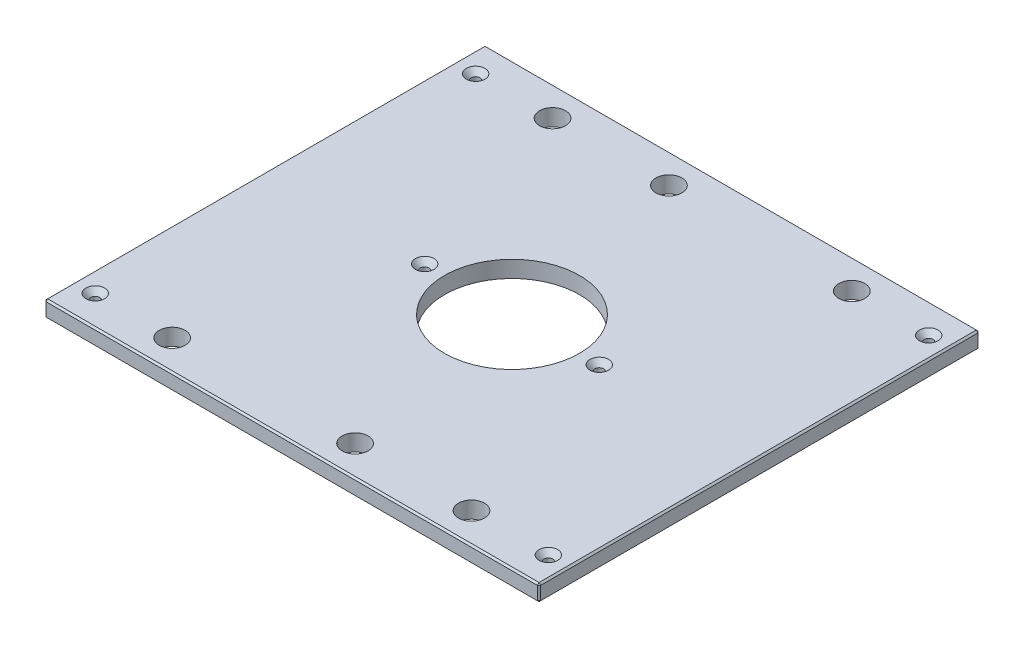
ISO-10303-21;
HEADER;
FILE_DESCRIPTION(('STEP AP214'),'2;1');
FILE_NAME('part.step','',(''),(''),'','','');
FILE_SCHEMA(('AUTOMOTIVE_DESIGN { 1 0 10303 214 1 1 1 1 }'));
ENDSEC;
DATA;
#1=APPLICATION_CONTEXT('core data for automotive mechanical design processes');
#2=APPLICATION_PROTOCOL_DEFINITION('international standard','automotive_design',2000,#1);
#3=PRODUCT_CONTEXT('',#1,'mechanical');
#4=PRODUCT('Part','Part','',(#3));
#5=PRODUCT_RELATED_PRODUCT_CATEGORY('part','',(#4));
#6=PRODUCT_DEFINITION_FORMATION('','',#4);
#7=PRODUCT_DEFINITION_CONTEXT('part definition',#1,'design');
#8=PRODUCT_DEFINITION('design','',#6,#7);
#9=PRODUCT_DEFINITION_SHAPE('','',#8);
#10=(LENGTH_UNIT() NAMED_UNIT(*) SI_UNIT(.MILLI.,.METRE.));
#11=(NAMED_UNIT(*) PLANE_ANGLE_UNIT() SI_UNIT($,.RADIAN.));
#12=(NAMED_UNIT(*) SI_UNIT($,.STERADIAN.) SOLID_ANGLE_UNIT());
#13=UNCERTAINTY_MEASURE_WITH_UNIT(LENGTH_MEASURE(1.E-05),#10,'distance_accuracy_value','');
#14=(GEOMETRIC_REPRESENTATION_CONTEXT(3) GLOBAL_UNCERTAINTY_ASSIGNED_CONTEXT((#13)) GLOBAL_UNIT_ASSIGNED_CONTEXT((#10,
#11,#12)) REPRESENTATION_CONTEXT('',''));
#15=CARTESIAN_POINT('',(0.,0.,0.));
#16=DIRECTION('',(0.,0.,1.));
#17=DIRECTION('',(1.,0.,0.));
#18=AXIS2_PLACEMENT_3D('',#15,#16,#17);
#19=CARTESIAN_POINT('',(-188.9125,12.7,-168.275));
#20=DIRECTION('',(1.,0.,0.));
#21=DIRECTION('',(0.,0.,-1.));
#22=AXIS2_PLACEMENT_3D('',#19,#20,#21);
#23=PLANE('',#22);
#24=DIRECTION('',(0.,0.,-1.));
#25=VECTOR('',#24,1.);
#26=CARTESIAN_POINT('',(-188.9125,11.4300000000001,-168.275));
#27=LINE('',#26,#25);
#28=CARTESIAN_POINT('',(-188.9125,11.4300000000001,167.005));
#29=VERTEX_POINT('',#28);
#30=CARTESIAN_POINT('',(-188.9125,11.4300000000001,-167.005));
#31=VERTEX_POINT('',#30);
#32=EDGE_CURVE('E134',#29,#31,#27,.T.);
#33=ORIENTED_EDGE('',*,*,#32,.T.);
#34=DIRECTION('',(0.,-1.,0.));
#35=VECTOR('',#34,1.);
#36=CARTESIAN_POINT('',(-188.9125,12.7,-167.005));
#37=LINE('',#36,#35);
#38=CARTESIAN_POINT('',(-188.9125,1.26999999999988,-167.005));
#39=VERTEX_POINT('',#38);
#40=EDGE_CURVE('E130',#31,#39,#37,.T.);
#41=ORIENTED_EDGE('',*,*,#40,.T.);
#42=DIRECTION('',(0.,0.,1.));
#43=VECTOR('',#42,1.);
#44=CARTESIAN_POINT('',(-188.9125,1.26999999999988,-168.275));
#45=LINE('',#44,#43);
#46=CARTESIAN_POINT('',(-188.9125,1.26999999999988,167.005));
#47=VERTEX_POINT('',#46);
#48=EDGE_CURVE('E125',#39,#47,#45,.T.);
#49=ORIENTED_EDGE('',*,*,#48,.T.);
#50=DIRECTION('',(0.,1.,0.));
#51=VECTOR('',#50,1.);
#52=CARTESIAN_POINT('',(-188.9125,12.7,167.005));
#53=LINE('',#52,#51);
#54=EDGE_CURVE('E127',#47,#29,#53,.T.);
#55=ORIENTED_EDGE('',*,*,#54,.T.);
#56=EDGE_LOOP('',(#33,#41,#49,#55));
#57=FACE_BOUND('',#56,.T.);
#58=ADVANCED_FACE('F34',(#57),#23,.F.);
#59=CARTESIAN_POINT('',(-188.9125,12.7,168.275));
#60=DIRECTION('',(0.,0.,-1.));
#61=DIRECTION('',(-1.,0.,0.));
#62=AXIS2_PLACEMENT_3D('',#59,#60,#61);
#63=PLANE('',#62);
#64=DIRECTION('',(1.,0.,0.));
#65=VECTOR('',#64,1.);
#66=CARTESIAN_POINT('',(-188.9125,1.26999999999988,168.275));
#67=LINE('',#66,#65);
#68=CARTESIAN_POINT('',(-187.6425,1.26999999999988,168.275));
#69=VERTEX_POINT('',#68);
#70=CARTESIAN_POINT('',(187.6425,1.26999999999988,168.275));
#71=VERTEX_POINT('',#70);
#72=EDGE_CURVE('E57',#69,#71,#67,.T.);
#73=ORIENTED_EDGE('',*,*,#72,.T.);
#74=DIRECTION('',(0.,1.,0.));
#75=VECTOR('',#74,1.);
#76=CARTESIAN_POINT('',(187.6425,12.7,168.275));
#77=LINE('',#76,#75);
#78=CARTESIAN_POINT('',(187.6425,11.4300000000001,168.275));
#79=VERTEX_POINT('',#78);
#80=EDGE_CURVE('E11',#71,#79,#77,.T.);
#81=ORIENTED_EDGE('',*,*,#80,.T.);
#82=DIRECTION('',(-1.,0.,0.));
#83=VECTOR('',#82,1.);
#84=CARTESIAN_POINT('',(-188.9125,11.4300000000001,168.275));
#85=LINE('',#84,#83);
#86=CARTESIAN_POINT('',(-187.6425,11.4300000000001,168.275));
#87=VERTEX_POINT('',#86);
#88=EDGE_CURVE('E43',#79,#87,#85,.T.);
#89=ORIENTED_EDGE('',*,*,#88,.T.);
#90=DIRECTION('',(0.,-1.,0.));
#91=VECTOR('',#90,1.);
#92=CARTESIAN_POINT('',(-187.6425,12.7,168.275));
#93=LINE('',#92,#91);
#94=EDGE_CURVE('E290',#87,#69,#93,.T.);
#95=ORIENTED_EDGE('',*,*,#94,.T.);
#96=EDGE_LOOP('',(#73,#81,#89,#95));
#97=FACE_BOUND('',#96,.T.);
#98=ADVANCED_FACE('F359',(#97),#63,.F.);
#99=CARTESIAN_POINT('',(188.9125,12.7,-168.275));
#100=DIRECTION('',(-1.,0.,0.));
#101=DIRECTION('',(0.,0.,1.));
#102=AXIS2_PLACEMENT_3D('',#99,#100,#101);
#103=PLANE('',#102);
#104=DIRECTION('',(0.,0.,-1.));
#105=VECTOR('',#104,1.);
#106=CARTESIAN_POINT('',(188.9125,1.26999999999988,-168.275));
#107=LINE('',#106,#105);
#108=CARTESIAN_POINT('',(188.9125,1.26999999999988,167.005));
#109=VERTEX_POINT('',#108);
#110=CARTESIAN_POINT('',(188.9125,1.26999999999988,-167.005));
#111=VERTEX_POINT('',#110);
#112=EDGE_CURVE('E285',#109,#111,#107,.T.);
#113=ORIENTED_EDGE('',*,*,#112,.T.);
#114=DIRECTION('',(0.,1.,0.));
#115=VECTOR('',#114,1.);
#116=CARTESIAN_POINT('',(188.9125,12.7,-167.005));
#117=LINE('',#116,#115);
#118=CARTESIAN_POINT('',(188.9125,11.4300000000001,-167.005));
#119=VERTEX_POINT('',#118);
#120=EDGE_CURVE('E287',#111,#119,#117,.T.);
#121=ORIENTED_EDGE('',*,*,#120,.T.);
#122=DIRECTION('',(0.,0.,1.));
#123=VECTOR('',#122,1.);
#124=CARTESIAN_POINT('',(188.9125,11.4300000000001,168.275));
#125=LINE('',#124,#123);
#126=CARTESIAN_POINT('',(188.9125,11.4300000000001,167.005));
#127=VERTEX_POINT('',#126);
#128=EDGE_CURVE('E283',#119,#127,#125,.T.);
#129=ORIENTED_EDGE('',*,*,#128,.T.);
#130=DIRECTION('',(0.,-1.,0.));
#131=VECTOR('',#130,1.);
#132=CARTESIAN_POINT('',(188.9125,12.7,167.005));
#133=LINE('',#132,#131);
#134=EDGE_CURVE('E281',#127,#109,#133,.T.);
#135=ORIENTED_EDGE('',*,*,#134,.T.);
#136=EDGE_LOOP('',(#113,#121,#129,#135));
#137=FACE_BOUND('',#136,.T.);
#138=ADVANCED_FACE('F346',(#137),#103,.F.);
#139=CARTESIAN_POINT('',(-188.9125,12.7,-168.275));
#140=DIRECTION('',(0.,0.,1.));
#141=DIRECTION('',(1.,0.,0.));
#142=AXIS2_PLACEMENT_3D('',#139,#140,#141);
#143=PLANE('',#142);
#144=DIRECTION('',(-1.,0.,0.));
#145=VECTOR('',#144,1.);
#146=CARTESIAN_POINT('',(-188.9125,1.26999999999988,-168.275));
#147=LINE('',#146,#145);
#148=CARTESIAN_POINT('',(187.6425,1.26999999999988,-168.275));
#149=VERTEX_POINT('',#148);
#150=CARTESIAN_POINT('',(-187.6425,1.26999999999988,-168.275));
#151=VERTEX_POINT('',#150);
#152=EDGE_CURVE('E257',#149,#151,#147,.T.);
#153=ORIENTED_EDGE('',*,*,#152,.T.);
#154=DIRECTION('',(0.,1.,0.));
#155=VECTOR('',#154,1.);
#156=CARTESIAN_POINT('',(-187.6425,12.7,-168.275));
#157=LINE('',#156,#155);
#158=CARTESIAN_POINT('',(-187.6425,11.4300000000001,-168.275));
#159=VERTEX_POINT('',#158);
#160=EDGE_CURVE('E261',#151,#159,#157,.T.);
#161=ORIENTED_EDGE('',*,*,#160,.T.);
#162=DIRECTION('',(1.,0.,0.));
#163=VECTOR('',#162,1.);
#164=CARTESIAN_POINT('',(188.9125,11.4300000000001,-168.275));
#165=LINE('',#164,#163);
#166=CARTESIAN_POINT('',(187.6425,11.4300000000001,-168.275));
#167=VERTEX_POINT('',#166);
#168=EDGE_CURVE('E259',#159,#167,#165,.T.);
#169=ORIENTED_EDGE('',*,*,#168,.T.);
#170=DIRECTION('',(0.,-1.,0.));
#171=VECTOR('',#170,1.);
#172=CARTESIAN_POINT('',(187.6425,12.7,-168.275));
#173=LINE('',#172,#171);
#174=EDGE_CURVE('E255',#167,#149,#173,.T.);
#175=ORIENTED_EDGE('',*,*,#174,.T.);
#176=EDGE_LOOP('',(#153,#161,#169,#175));
#177=FACE_BOUND('',#176,.T.);
#178=ADVANCED_FACE('F320',(#177),#143,.F.);
#179=CARTESIAN_POINT('',(0.,12.7,0.));
#180=DIRECTION('',(0.,1.,0.));
#181=DIRECTION('',(0.,0.,1.));
#182=AXIS2_PLACEMENT_3D('',#179,#180,#181);
#183=PLANE('',#182);
#184=CARTESIAN_POINT('',(173.0375,12.7,-145.25498));
#185=DIRECTION('',(0.,1.,0.));
#186=DIRECTION('',(0.,0.,1.));
#187=AXIS2_PLACEMENT_3D('',#184,#185,#186);
#188=CIRCLE('',#187,7.13739999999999);
#189=CARTESIAN_POINT('',(173.0375,12.7,-138.11758));
#190=VERTEX_POINT('',#189);
#191=EDGE_CURVE('E783',#190,#190,#188,.T.);
#192=ORIENTED_EDGE('',*,*,#191,.F.);
#193=EDGE_LOOP('',(#192));
#194=FACE_BOUND('',#193,.T.);
#195=CARTESIAN_POINT('',(173.0375,12.7,145.25498));
#196=DIRECTION('',(0.,1.,0.));
#197=DIRECTION('',(0.,0.,1.));
#198=AXIS2_PLACEMENT_3D('',#195,#196,#197);
#199=CIRCLE('',#198,7.13739999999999);
#200=CARTESIAN_POINT('',(173.0375,12.7,152.39238));
#201=VERTEX_POINT('',#200);
#202=EDGE_CURVE('E787',#201,#201,#199,.T.);
#203=ORIENTED_EDGE('',*,*,#202,.F.);
#204=EDGE_LOOP('',(#203));
#205=FACE_BOUND('',#204,.T.);
#206=CARTESIAN_POINT('',(-173.0375,12.7,145.25498));
#207=DIRECTION('',(0.,1.,0.));
#208=DIRECTION('',(0.,0.,1.));
#209=AXIS2_PLACEMENT_3D('',#206,#207,#208);
#210=CIRCLE('',#209,7.13739999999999);
#211=CARTESIAN_POINT('',(-173.0375,12.7,152.39238));
#212=VERTEX_POINT('',#211);
#213=EDGE_CURVE('E791',#212,#212,#210,.T.);
#214=ORIENTED_EDGE('',*,*,#213,.F.);
#215=EDGE_LOOP('',(#214));
#216=FACE_BOUND('',#215,.T.);
#217=CARTESIAN_POINT('',(-66.675,12.7,0.));
#218=DIRECTION('',(0.,1.,0.));
#219=DIRECTION('',(0.,0.,1.));
#220=AXIS2_PLACEMENT_3D('',#217,#218,#219);
#221=CIRCLE('',#220,7.1374);
#222=CARTESIAN_POINT('',(-66.675,12.7,7.1374));
#223=VERTEX_POINT('',#222);
#224=EDGE_CURVE('E795',#223,#223,#221,.T.);
#225=ORIENTED_EDGE('',*,*,#224,.F.);
#226=EDGE_LOOP('',(#225));
#227=FACE_BOUND('',#226,.T.);
#228=CARTESIAN_POINT('',(66.675,12.7,0.));
#229=DIRECTION('',(0.,1.,0.));
#230=DIRECTION('',(0.,0.,1.));
#231=AXIS2_PLACEMENT_3D('',#228,#229,#230);
#232=CIRCLE('',#231,7.1374);
#233=CARTESIAN_POINT('',(66.675,12.7,7.1374));
#234=VERTEX_POINT('',#233);
#235=EDGE_CURVE('E799',#234,#234,#232,.T.);
#236=ORIENTED_EDGE('',*,*,#235,.F.);
#237=EDGE_LOOP('',(#236));
#238=FACE_BOUND('',#237,.T.);
#239=CARTESIAN_POINT('',(-173.0375,12.7,-145.25498));
#240=DIRECTION('',(0.,1.,0.));
#241=DIRECTION('',(0.,0.,1.));
#242=AXIS2_PLACEMENT_3D('',#239,#240,#241);
#243=CIRCLE('',#242,7.13739999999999);
#244=CARTESIAN_POINT('',(-173.0375,12.7,-138.11758));
#245=VERTEX_POINT('',#244);
#246=EDGE_CURVE('E802',#245,#245,#243,.T.);
#247=ORIENTED_EDGE('',*,*,#246,.F.);
#248=EDGE_LOOP('',(#247));
#249=FACE_BOUND('',#248,.T.);
#250=DIRECTION('',(0.,0.,-1.));
#251=VECTOR('',#250,1.);
#252=CARTESIAN_POINT('',(187.6425,12.7,-168.275));
#253=LINE('',#252,#251);
#254=CARTESIAN_POINT('',(187.6425,12.7,167.005));
#255=VERTEX_POINT('',#254);
#256=CARTESIAN_POINT('',(187.6425,12.7,-167.005));
#257=VERTEX_POINT('',#256);
#258=EDGE_CURVE('E268',#255,#257,#253,.T.);
#259=ORIENTED_EDGE('',*,*,#258,.T.);
#260=DIRECTION('',(-1.,0.,0.));
#261=VECTOR('',#260,1.);
#262=CARTESIAN_POINT('',(-188.9125,12.7,-167.005));
#263=LINE('',#262,#261);
#264=CARTESIAN_POINT('',(-187.6425,12.7,-167.005));
#265=VERTEX_POINT('',#264);
#266=EDGE_CURVE('E270',#257,#265,#263,.T.);
#267=ORIENTED_EDGE('',*,*,#266,.T.);
#268=DIRECTION('',(0.,0.,1.));
#269=VECTOR('',#268,1.);
#270=CARTESIAN_POINT('',(-187.6425,12.7,168.275));
#271=LINE('',#270,#269);
#272=CARTESIAN_POINT('',(-187.6425,12.7,167.005));
#273=VERTEX_POINT('',#272);
#274=EDGE_CURVE('E266',#265,#273,#271,.T.);
#275=ORIENTED_EDGE('',*,*,#274,.T.);
#276=DIRECTION('',(1.,0.,0.));
#277=VECTOR('',#276,1.);
#278=CARTESIAN_POINT('',(188.9125,12.7,167.005));
#279=LINE('',#278,#277);
#280=EDGE_CURVE('E264',#273,#255,#279,.T.);
#281=ORIENTED_EDGE('',*,*,#280,.T.);
#282=EDGE_LOOP('',(#259,#267,#275,#281));
#283=FACE_BOUND('',#282,.T.);
#284=CARTESIAN_POINT('',(114.3,12.7,-145.25498));
#285=DIRECTION('',(0.,1.,0.));
#286=DIRECTION('',(0.,0.,1.));
#287=AXIS2_PLACEMENT_3D('',#284,#285,#286);
#288=CIRCLE('',#287,9.921875);
#289=CARTESIAN_POINT('',(114.3,12.7,-135.333105));
#290=VERTEX_POINT('',#289);
#291=EDGE_CURVE('E203',#290,#290,#288,.T.);
#292=ORIENTED_EDGE('',*,*,#291,.F.);
#293=EDGE_LOOP('',(#292));
#294=FACE_BOUND('',#293,.T.);
#295=CARTESIAN_POINT('',(-114.3,12.7,-145.25498));
#296=DIRECTION('',(0.,1.,0.));
#297=DIRECTION('',(0.,0.,1.));
#298=AXIS2_PLACEMENT_3D('',#295,#296,#297);
#299=CIRCLE('',#298,9.921875);
#300=CARTESIAN_POINT('',(-114.3,12.7,-135.333105));
#301=VERTEX_POINT('',#300);
#302=EDGE_CURVE('E213',#301,#301,#299,.T.);
#303=ORIENTED_EDGE('',*,*,#302,.F.);
#304=EDGE_LOOP('',(#303));
#305=FACE_BOUND('',#304,.T.);
#306=CARTESIAN_POINT('',(114.3,12.7,145.25498));
#307=DIRECTION('',(0.,1.,0.));
#308=DIRECTION('',(0.,0.,1.));
#309=AXIS2_PLACEMENT_3D('',#306,#307,#308);
#310=CIRCLE('',#309,9.921875);
#311=CARTESIAN_POINT('',(114.3,12.7,155.176855));
#312=VERTEX_POINT('',#311);
#313=EDGE_CURVE('E224',#312,#312,#310,.T.);
#314=ORIENTED_EDGE('',*,*,#313,.F.);
#315=EDGE_LOOP('',(#314));
#316=FACE_BOUND('',#315,.T.);
#317=CARTESIAN_POINT('',(-114.3,12.7,145.25498));
#318=DIRECTION('',(0.,1.,0.));
#319=DIRECTION('',(0.,0.,1.));
#320=AXIS2_PLACEMENT_3D('',#317,#318,#319);
#321=CIRCLE('',#320,9.921875);
#322=CARTESIAN_POINT('',(-114.3,12.7,155.176855));
#323=VERTEX_POINT('',#322);
#324=EDGE_CURVE('E230',#323,#323,#321,.T.);
#325=ORIENTED_EDGE('',*,*,#324,.F.);
#326=EDGE_LOOP('',(#325));
#327=FACE_BOUND('',#326,.T.);
#328=CARTESIAN_POINT('',(-25.4,12.7,-145.25498));
#329=DIRECTION('',(0.,1.,0.));
#330=DIRECTION('',(0.,0.,1.));
#331=AXIS2_PLACEMENT_3D('',#328,#329,#330);
#332=CIRCLE('',#331,9.921875);
#333=CARTESIAN_POINT('',(-25.4,12.7,-135.333105));
#334=VERTEX_POINT('',#333);
#335=EDGE_CURVE('E236',#334,#334,#332,.T.);
#336=ORIENTED_EDGE('',*,*,#335,.F.);
#337=EDGE_LOOP('',(#336));
#338=FACE_BOUND('',#337,.T.);
#339=CARTESIAN_POINT('',(25.4,12.7,145.25498));
#340=DIRECTION('',(0.,1.,0.));
#341=DIRECTION('',(0.,0.,1.));
#342=AXIS2_PLACEMENT_3D('',#339,#340,#341);
#343=CIRCLE('',#342,9.921875);
#344=CARTESIAN_POINT('',(25.4,12.7,155.176855));
#345=VERTEX_POINT('',#344);
#346=EDGE_CURVE('E242',#345,#345,#343,.T.);
#347=ORIENTED_EDGE('',*,*,#346,.F.);
#348=EDGE_LOOP('',(#347));
#349=FACE_BOUND('',#348,.T.);
#350=CARTESIAN_POINT('',(0.,12.7,0.));
#351=DIRECTION('',(0.,1.,0.));
#352=DIRECTION('',(0.,0.,1.));
#353=AXIS2_PLACEMENT_3D('',#350,#351,#352);
#354=CIRCLE('',#353,51.562);
#355=CARTESIAN_POINT('',(0.,12.7,51.562));
#356=VERTEX_POINT('',#355);
#357=EDGE_CURVE('E248',#356,#356,#354,.T.);
#358=ORIENTED_EDGE('',*,*,#357,.F.);
#359=EDGE_LOOP('',(#358));
#360=FACE_BOUND('',#359,.T.);
#361=ADVANCED_FACE('F368',(#194,#205,#216,#227,#238,#249,#283,#294,#305,#316,#327,#338,#349,
#360),#183,.T.);
#362=CARTESIAN_POINT('',(0.,0.,0.));
#363=DIRECTION('',(0.,1.,0.));
#364=DIRECTION('',(0.,0.,1.));
#365=AXIS2_PLACEMENT_3D('',#362,#363,#364);
#366=PLANE('',#365);
#367=CARTESIAN_POINT('',(173.0375,0.,-145.25498));
#368=DIRECTION('',(0.,1.,0.));
#369=DIRECTION('',(0.,0.,1.));
#370=AXIS2_PLACEMENT_3D('',#367,#368,#369);
#371=CIRCLE('',#370,3.3782);
#372=CARTESIAN_POINT('',(173.0375,0.,-141.87678));
#373=VERTEX_POINT('',#372);
#374=EDGE_CURVE('E836',#373,#373,#371,.T.);
#375=ORIENTED_EDGE('',*,*,#374,.T.);
#376=EDGE_LOOP('',(#375));
#377=FACE_BOUND('',#376,.T.);
#378=CARTESIAN_POINT('',(173.0375,0.,145.25498));
#379=DIRECTION('',(0.,1.,0.));
#380=DIRECTION('',(0.,0.,1.));
#381=AXIS2_PLACEMENT_3D('',#378,#379,#380);
#382=CIRCLE('',#381,3.3782);
#383=CARTESIAN_POINT('',(173.0375,0.,148.63318));
#384=VERTEX_POINT('',#383);
#385=EDGE_CURVE('E829',#384,#384,#382,.T.);
#386=ORIENTED_EDGE('',*,*,#385,.T.);
#387=EDGE_LOOP('',(#386));
#388=FACE_BOUND('',#387,.T.);
#389=CARTESIAN_POINT('',(-173.0375,0.,145.25498));
#390=DIRECTION('',(0.,1.,0.));
#391=DIRECTION('',(0.,0.,1.));
#392=AXIS2_PLACEMENT_3D('',#389,#390,#391);
#393=CIRCLE('',#392,3.3782);
#394=CARTESIAN_POINT('',(-173.0375,0.,148.63318));
#395=VERTEX_POINT('',#394);
#396=EDGE_CURVE('E822',#395,#395,#393,.T.);
#397=ORIENTED_EDGE('',*,*,#396,.T.);
#398=EDGE_LOOP('',(#397));
#399=FACE_BOUND('',#398,.T.);
#400=CARTESIAN_POINT('',(-66.675,0.,0.));
#401=DIRECTION('',(0.,1.,0.));
#402=DIRECTION('',(0.,0.,1.));
#403=AXIS2_PLACEMENT_3D('',#400,#401,#402);
#404=CIRCLE('',#403,3.3782);
#405=CARTESIAN_POINT('',(-66.675,0.,3.3782));
#406=VERTEX_POINT('',#405);
#407=EDGE_CURVE('E815',#406,#406,#404,.T.);
#408=ORIENTED_EDGE('',*,*,#407,.T.);
#409=EDGE_LOOP('',(#408));
#410=FACE_BOUND('',#409,.T.);
#411=CARTESIAN_POINT('',(66.675,0.,0.));
#412=DIRECTION('',(0.,1.,0.));
#413=DIRECTION('',(0.,0.,1.));
#414=AXIS2_PLACEMENT_3D('',#411,#412,#413);
#415=CIRCLE('',#414,3.3782);
#416=CARTESIAN_POINT('',(66.675,0.,3.3782));
#417=VERTEX_POINT('',#416);
#418=EDGE_CURVE('E805',#417,#417,#415,.T.);
#419=ORIENTED_EDGE('',*,*,#418,.T.);
#420=EDGE_LOOP('',(#419));
#421=FACE_BOUND('',#420,.T.);
#422=CARTESIAN_POINT('',(-173.0375,0.,-145.25498));
#423=DIRECTION('',(0.,1.,0.));
#424=DIRECTION('',(0.,0.,1.));
#425=AXIS2_PLACEMENT_3D('',#422,#423,#424);
#426=CIRCLE('',#425,3.3782);
#427=CARTESIAN_POINT('',(-173.0375,0.,-141.87678));
#428=VERTEX_POINT('',#427);
#429=EDGE_CURVE('E216',#428,#428,#426,.T.);
#430=ORIENTED_EDGE('',*,*,#429,.T.);
#431=EDGE_LOOP('',(#430));
#432=FACE_BOUND('',#431,.T.);
#433=DIRECTION('',(0.,0.,-1.));
#434=VECTOR('',#433,1.);
#435=CARTESIAN_POINT('',(-187.6425,0.,0.));
#436=LINE('',#435,#434);
#437=CARTESIAN_POINT('',(-187.6425,0.,167.005));
#438=VERTEX_POINT('',#437);
#439=CARTESIAN_POINT('',(-187.6425,0.,-167.005));
#440=VERTEX_POINT('',#439);
#441=EDGE_CURVE('E157',#438,#440,#436,.T.);
#442=ORIENTED_EDGE('',*,*,#441,.T.);
#443=DIRECTION('',(1.,0.,0.));
#444=VECTOR('',#443,1.);
#445=CARTESIAN_POINT('',(0.,0.,-167.005));
#446=LINE('',#445,#444);
#447=CARTESIAN_POINT('',(187.6425,0.,-167.005));
#448=VERTEX_POINT('',#447);
#449=EDGE_CURVE('E278',#440,#448,#446,.T.);
#450=ORIENTED_EDGE('',*,*,#449,.T.);
#451=DIRECTION('',(0.,0.,1.));
#452=VECTOR('',#451,1.);
#453=CARTESIAN_POINT('',(187.6425,0.,0.));
#454=LINE('',#453,#452);
#455=CARTESIAN_POINT('',(187.6425,0.,167.005));
#456=VERTEX_POINT('',#455);
#457=EDGE_CURVE('E276',#448,#456,#454,.T.);
#458=ORIENTED_EDGE('',*,*,#457,.T.);
#459=DIRECTION('',(-1.,0.,0.));
#460=VECTOR('',#459,1.);
#461=CARTESIAN_POINT('',(0.,0.,167.005));
#462=LINE('',#461,#460);
#463=EDGE_CURVE('E273',#456,#438,#462,.T.);
#464=ORIENTED_EDGE('',*,*,#463,.T.);
#465=EDGE_LOOP('',(#442,#450,#458,#464));
#466=FACE_BOUND('',#465,.T.);
#467=CARTESIAN_POINT('',(114.3,0.,-145.25498));
#468=DIRECTION('',(0.,1.,0.));
#469=DIRECTION('',(0.,0.,1.));
#470=AXIS2_PLACEMENT_3D('',#467,#468,#469);
#471=CIRCLE('',#470,9.921875);
#472=CARTESIAN_POINT('',(114.3,0.,-135.333105));
#473=VERTEX_POINT('',#472);
#474=EDGE_CURVE('E208',#473,#473,#471,.T.);
#475=ORIENTED_EDGE('',*,*,#474,.T.);
#476=EDGE_LOOP('',(#475));
#477=FACE_BOUND('',#476,.T.);
#478=CARTESIAN_POINT('',(-114.3,0.,-145.25498));
#479=DIRECTION('',(0.,1.,0.));
#480=DIRECTION('',(0.,0.,1.));
#481=AXIS2_PLACEMENT_3D('',#478,#479,#480);
#482=CIRCLE('',#481,9.921875);
#483=CARTESIAN_POINT('',(-114.3,0.,-135.333105));
#484=VERTEX_POINT('',#483);
#485=EDGE_CURVE('E221',#484,#484,#482,.T.);
#486=ORIENTED_EDGE('',*,*,#485,.T.);
#487=EDGE_LOOP('',(#486));
#488=FACE_BOUND('',#487,.T.);
#489=CARTESIAN_POINT('',(114.3,0.,145.25498));
#490=DIRECTION('',(0.,1.,0.));
#491=DIRECTION('',(0.,0.,1.));
#492=AXIS2_PLACEMENT_3D('',#489,#490,#491);
#493=CIRCLE('',#492,9.921875);
#494=CARTESIAN_POINT('',(114.3,0.,155.176855));
#495=VERTEX_POINT('',#494);
#496=EDGE_CURVE('E227',#495,#495,#493,.T.);
#497=ORIENTED_EDGE('',*,*,#496,.T.);
#498=EDGE_LOOP('',(#497));
#499=FACE_BOUND('',#498,.T.);
#500=CARTESIAN_POINT('',(-114.3,0.,145.25498));
#501=DIRECTION('',(0.,1.,0.));
#502=DIRECTION('',(0.,0.,1.));
#503=AXIS2_PLACEMENT_3D('',#500,#501,#502);
#504=CIRCLE('',#503,9.921875);
#505=CARTESIAN_POINT('',(-114.3,0.,155.176855));
#506=VERTEX_POINT('',#505);
#507=EDGE_CURVE('E233',#506,#506,#504,.T.);
#508=ORIENTED_EDGE('',*,*,#507,.T.);
#509=EDGE_LOOP('',(#508));
#510=FACE_BOUND('',#509,.T.);
#511=CARTESIAN_POINT('',(-25.4,0.,-145.25498));
#512=DIRECTION('',(0.,1.,0.));
#513=DIRECTION('',(0.,0.,1.));
#514=AXIS2_PLACEMENT_3D('',#511,#512,#513);
#515=CIRCLE('',#514,9.921875);
#516=CARTESIAN_POINT('',(-25.4,0.,-135.333105));
#517=VERTEX_POINT('',#516);
#518=EDGE_CURVE('E239',#517,#517,#515,.T.);
#519=ORIENTED_EDGE('',*,*,#518,.T.);
#520=EDGE_LOOP('',(#519));
#521=FACE_BOUND('',#520,.T.);
#522=CARTESIAN_POINT('',(25.4,0.,145.25498));
#523=DIRECTION('',(0.,1.,0.));
#524=DIRECTION('',(0.,0.,1.));
#525=AXIS2_PLACEMENT_3D('',#522,#523,#524);
#526=CIRCLE('',#525,9.921875);
#527=CARTESIAN_POINT('',(25.4,0.,155.176855));
#528=VERTEX_POINT('',#527);
#529=EDGE_CURVE('E245',#528,#528,#526,.T.);
#530=ORIENTED_EDGE('',*,*,#529,.T.);
#531=EDGE_LOOP('',(#530));
#532=FACE_BOUND('',#531,.T.);
#533=CARTESIAN_POINT('',(0.,0.,0.));
#534=DIRECTION('',(0.,1.,0.));
#535=DIRECTION('',(0.,0.,1.));
#536=AXIS2_PLACEMENT_3D('',#533,#534,#535);
#537=CIRCLE('',#536,51.562);
#538=CARTESIAN_POINT('',(0.,0.,51.562));
#539=VERTEX_POINT('',#538);
#540=EDGE_CURVE('E146',#539,#539,#537,.T.);
#541=ORIENTED_EDGE('',*,*,#540,.T.);
#542=EDGE_LOOP('',(#541));
#543=FACE_BOUND('',#542,.T.);
#544=ADVANCED_FACE('F333',(#377,#388,#399,#410,#421,#432,#466,#477,#488,#499,#510,#521,#532,
#543),#366,.F.);
#545=CARTESIAN_POINT('',(0.,0.,0.));
#546=DIRECTION('',(0.,1.,0.));
#547=DIRECTION('',(0.,0.,1.));
#548=AXIS2_PLACEMENT_3D('',#545,#546,#547);
#549=CYLINDRICAL_SURFACE('',#548,51.562);
#550=ORIENTED_EDGE('',*,*,#540,.F.);
#551=EDGE_LOOP('',(#550));
#552=FACE_BOUND('',#551,.T.);
#553=ORIENTED_EDGE('',*,*,#357,.T.);
#554=EDGE_LOOP('',(#553));
#555=FACE_BOUND('',#554,.T.);
#556=ADVANCED_FACE('F720',(#552,#555),#549,.F.);
#557=CARTESIAN_POINT('',(25.4,12.7,145.25498));
#558=DIRECTION('',(0.,1.,0.));
#559=DIRECTION('',(0.,0.,1.));
#560=AXIS2_PLACEMENT_3D('',#557,#558,#559);
#561=CYLINDRICAL_SURFACE('',#560,9.921875);
#562=ORIENTED_EDGE('',*,*,#529,.F.);
#563=EDGE_LOOP('',(#562));
#564=FACE_BOUND('',#563,.T.);
#565=ORIENTED_EDGE('',*,*,#346,.T.);
#566=EDGE_LOOP('',(#565));
#567=FACE_BOUND('',#566,.T.);
#568=ADVANCED_FACE('F711',(#564,#567),#561,.F.);
#569=CARTESIAN_POINT('',(-25.4,12.7,-145.25498));
#570=DIRECTION('',(0.,1.,0.));
#571=DIRECTION('',(0.,0.,1.));
#572=AXIS2_PLACEMENT_3D('',#569,#570,#571);
#573=CYLINDRICAL_SURFACE('',#572,9.921875);
#574=ORIENTED_EDGE('',*,*,#518,.F.);
#575=EDGE_LOOP('',(#574));
#576=FACE_BOUND('',#575,.T.);
#577=ORIENTED_EDGE('',*,*,#335,.T.);
#578=EDGE_LOOP('',(#577));
#579=FACE_BOUND('',#578,.T.);
#580=ADVANCED_FACE('F702',(#576,#579),#573,.F.);
#581=CARTESIAN_POINT('',(-114.3,12.7,145.25498));
#582=DIRECTION('',(0.,1.,0.));
#583=DIRECTION('',(0.,0.,1.));
#584=AXIS2_PLACEMENT_3D('',#581,#582,#583);
#585=CYLINDRICAL_SURFACE('',#584,9.921875);
#586=ORIENTED_EDGE('',*,*,#507,.F.);
#587=EDGE_LOOP('',(#586));
#588=FACE_BOUND('',#587,.T.);
#589=ORIENTED_EDGE('',*,*,#324,.T.);
#590=EDGE_LOOP('',(#589));
#591=FACE_BOUND('',#590,.T.);
#592=ADVANCED_FACE('F693',(#588,#591),#585,.F.);
#593=CARTESIAN_POINT('',(114.3,12.7,145.25498));
#594=DIRECTION('',(0.,1.,0.));
#595=DIRECTION('',(0.,0.,1.));
#596=AXIS2_PLACEMENT_3D('',#593,#594,#595);
#597=CYLINDRICAL_SURFACE('',#596,9.921875);
#598=ORIENTED_EDGE('',*,*,#496,.F.);
#599=EDGE_LOOP('',(#598));
#600=FACE_BOUND('',#599,.T.);
#601=ORIENTED_EDGE('',*,*,#313,.T.);
#602=EDGE_LOOP('',(#601));
#603=FACE_BOUND('',#602,.T.);
#604=ADVANCED_FACE('F684',(#600,#603),#597,.F.);
#605=CARTESIAN_POINT('',(-114.3,12.7,-145.25498));
#606=DIRECTION('',(0.,1.,0.));
#607=DIRECTION('',(0.,0.,1.));
#608=AXIS2_PLACEMENT_3D('',#605,#606,#607);
#609=CYLINDRICAL_SURFACE('',#608,9.921875);
#610=ORIENTED_EDGE('',*,*,#485,.F.);
#611=EDGE_LOOP('',(#610));
#612=FACE_BOUND('',#611,.T.);
#613=ORIENTED_EDGE('',*,*,#302,.T.);
#614=EDGE_LOOP('',(#613));
#615=FACE_BOUND('',#614,.T.);
#616=ADVANCED_FACE('F674',(#612,#615),#609,.F.);
#617=CARTESIAN_POINT('',(114.3,12.7,-145.25498));
#618=DIRECTION('',(0.,1.,0.));
#619=DIRECTION('',(0.,0.,1.));
#620=AXIS2_PLACEMENT_3D('',#617,#618,#619);
#621=CYLINDRICAL_SURFACE('',#620,9.921875);
#622=ORIENTED_EDGE('',*,*,#474,.F.);
#623=EDGE_LOOP('',(#622));
#624=FACE_BOUND('',#623,.T.);
#625=ORIENTED_EDGE('',*,*,#291,.T.);
#626=EDGE_LOOP('',(#625));
#627=FACE_BOUND('',#626,.T.);
#628=ADVANCED_FACE('F377',(#624,#627),#621,.F.);
#629=CARTESIAN_POINT('',(188.9125,12.7,167.005));
#630=DIRECTION('',(-0.707106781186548,0.,-0.707106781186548));
#631=DIRECTION('',(0.,-1.,0.));
#632=AXIS2_PLACEMENT_3D('',#629,#630,#631);
#633=PLANE('',#632);
#634=DIRECTION('',(-0.707106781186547,0.,0.707106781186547));
#635=VECTOR('',#634,1.);
#636=CARTESIAN_POINT('',(188.9125,11.4300000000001,167.005));
#637=LINE('',#636,#635);
#638=EDGE_CURVE('E38',#79,#127,#637,.F.);
#639=ORIENTED_EDGE('',*,*,#638,.F.);
#640=ORIENTED_EDGE('',*,*,#80,.F.);
#641=DIRECTION('',(0.707106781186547,0.,-0.707106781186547));
#642=VECTOR('',#641,1.);
#643=CARTESIAN_POINT('',(188.2775,1.26999999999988,167.64));
#644=LINE('',#643,#642);
#645=EDGE_CURVE('E196',#109,#71,#644,.F.);
#646=ORIENTED_EDGE('',*,*,#645,.F.);
#647=ORIENTED_EDGE('',*,*,#134,.F.);
#648=EDGE_LOOP('',(#639,#640,#646,#647));
#649=FACE_BOUND('',#648,.T.);
#650=ADVANCED_FACE('F36',(#649),#633,.F.);
#651=CARTESIAN_POINT('',(188.9125,11.4300000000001,167.005));
#652=DIRECTION('',(0.577350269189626,0.577350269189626,0.577350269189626));
#653=DIRECTION('',(0.707106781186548,0.,-0.707106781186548));
#654=AXIS2_PLACEMENT_3D('',#651,#652,#653);
#655=PLANE('',#654);
#656=DIRECTION('',(0.,-0.707106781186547,0.707106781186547));
#657=VECTOR('',#656,1.);
#658=CARTESIAN_POINT('',(187.6425,12.0650000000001,167.64));
#659=LINE('',#658,#657);
#660=EDGE_CURVE('E192',#79,#255,#659,.F.);
#661=ORIENTED_EDGE('',*,*,#660,.F.);
#662=ORIENTED_EDGE('',*,*,#638,.T.);
#663=DIRECTION('',(-0.707106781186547,0.707106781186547,0.));
#664=VECTOR('',#663,1.);
#665=CARTESIAN_POINT('',(188.9125,11.4300000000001,167.005));
#666=LINE('',#665,#664);
#667=EDGE_CURVE('E194',#255,#127,#666,.F.);
#668=ORIENTED_EDGE('',*,*,#667,.F.);
#669=EDGE_LOOP('',(#661,#662,#668));
#670=FACE_BOUND('',#669,.T.);
#671=ADVANCED_FACE('F370',(#670),#655,.T.);
#672=CARTESIAN_POINT('',(187.6425,0.,167.005));
#673=DIRECTION('',(0.577350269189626,-0.577350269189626,0.577350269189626));
#674=DIRECTION('',(0.707106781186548,0.,-0.707106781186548));
#675=AXIS2_PLACEMENT_3D('',#672,#673,#674);
#676=PLANE('',#675);
#677=DIRECTION('',(-0.707106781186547,-0.707106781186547,0.));
#678=VECTOR('',#677,1.);
#679=CARTESIAN_POINT('',(187.6425,0.,167.005));
#680=LINE('',#679,#678);
#681=EDGE_CURVE('E186',#109,#456,#680,.T.);
#682=ORIENTED_EDGE('',*,*,#681,.F.);
#683=ORIENTED_EDGE('',*,*,#645,.T.);
#684=DIRECTION('',(0.,0.707106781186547,0.707106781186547));
#685=VECTOR('',#684,1.);
#686=CARTESIAN_POINT('',(187.6425,0.,167.005));
#687=LINE('',#686,#685);
#688=EDGE_CURVE('E189',#456,#71,#687,.T.);
#689=ORIENTED_EDGE('',*,*,#688,.F.);
#690=EDGE_LOOP('',(#682,#683,#689));
#691=FACE_BOUND('',#690,.T.);
#692=ADVANCED_FACE('F339',(#691),#676,.T.);
#693=CARTESIAN_POINT('',(187.6425,12.7,0.));
#694=DIRECTION('',(0.707106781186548,0.707106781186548,0.));
#695=DIRECTION('',(0.,0.,1.));
#696=AXIS2_PLACEMENT_3D('',#693,#694,#695);
#697=PLANE('',#696);
#698=ORIENTED_EDGE('',*,*,#667,.T.);
#699=ORIENTED_EDGE('',*,*,#128,.F.);
#700=DIRECTION('',(0.707106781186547,-0.707106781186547,0.));
#701=VECTOR('',#700,1.);
#702=CARTESIAN_POINT('',(188.2775,12.0650000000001,-167.005));
#703=LINE('',#702,#701);
#704=EDGE_CURVE('E181',#257,#119,#703,.T.);
#705=ORIENTED_EDGE('',*,*,#704,.F.);
#706=ORIENTED_EDGE('',*,*,#258,.F.);
#707=EDGE_LOOP('',(#698,#699,#705,#706));
#708=FACE_BOUND('',#707,.T.);
#709=ADVANCED_FACE('F356',(#708),#697,.T.);
#710=CARTESIAN_POINT('',(0.,12.7,167.005));
#711=DIRECTION('',(0.,0.707106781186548,0.707106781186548));
#712=DIRECTION('',(-1.,0.,0.));
#713=AXIS2_PLACEMENT_3D('',#710,#711,#712);
#714=PLANE('',#713);
#715=ORIENTED_EDGE('',*,*,#660,.T.);
#716=ORIENTED_EDGE('',*,*,#280,.F.);
#717=DIRECTION('',(0.,0.707106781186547,-0.707106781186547));
#718=VECTOR('',#717,1.);
#719=CARTESIAN_POINT('',(-187.6425,12.7,167.005));
#720=LINE('',#719,#718);
#721=EDGE_CURVE('E178',#87,#273,#720,.T.);
#722=ORIENTED_EDGE('',*,*,#721,.F.);
#723=ORIENTED_EDGE('',*,*,#88,.F.);
#724=EDGE_LOOP('',(#715,#716,#722,#723));
#725=FACE_BOUND('',#724,.T.);
#726=ADVANCED_FACE('F361',(#725),#714,.T.);
#727=CARTESIAN_POINT('',(-187.6425,12.7,168.275));
#728=DIRECTION('',(0.707106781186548,0.,-0.707106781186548));
#729=DIRECTION('',(0.,-1.,0.));
#730=AXIS2_PLACEMENT_3D('',#727,#728,#729);
#731=PLANE('',#730);
#732=DIRECTION('',(0.707106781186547,0.,0.707106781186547));
#733=VECTOR('',#732,1.);
#734=CARTESIAN_POINT('',(-188.9125,1.26999999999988,167.005));
#735=LINE('',#734,#733);
#736=EDGE_CURVE('E141',#69,#47,#735,.F.);
#737=ORIENTED_EDGE('',*,*,#736,.F.);
#738=ORIENTED_EDGE('',*,*,#94,.F.);
#739=DIRECTION('',(-0.707106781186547,0.,-0.707106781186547));
#740=VECTOR('',#739,1.);
#741=CARTESIAN_POINT('',(-188.2775,11.4300000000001,167.64));
#742=LINE('',#741,#740);
#743=EDGE_CURVE('E144',#29,#87,#742,.F.);
#744=ORIENTED_EDGE('',*,*,#743,.F.);
#745=ORIENTED_EDGE('',*,*,#54,.F.);
#746=EDGE_LOOP('',(#737,#738,#744,#745));
#747=FACE_BOUND('',#746,.T.);
#748=ADVANCED_FACE('F139',(#747),#731,.F.);
#749=CARTESIAN_POINT('',(-188.9125,1.26999999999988,168.275));
#750=DIRECTION('',(0.,0.707106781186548,-0.707106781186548));
#751=DIRECTION('',(1.,0.,0.));
#752=AXIS2_PLACEMENT_3D('',#749,#750,#751);
#753=PLANE('',#752);
#754=ORIENTED_EDGE('',*,*,#688,.T.);
#755=ORIENTED_EDGE('',*,*,#72,.F.);
#756=DIRECTION('',(0.,-0.707106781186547,-0.707106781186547));
#757=VECTOR('',#756,1.);
#758=CARTESIAN_POINT('',(-187.6425,0.634999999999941,167.64));
#759=LINE('',#758,#757);
#760=EDGE_CURVE('E154',#438,#69,#759,.F.);
#761=ORIENTED_EDGE('',*,*,#760,.F.);
#762=ORIENTED_EDGE('',*,*,#463,.F.);
#763=EDGE_LOOP('',(#754,#755,#761,#762));
#764=FACE_BOUND('',#763,.T.);
#765=ADVANCED_FACE('F338',(#764),#753,.F.);
#766=CARTESIAN_POINT('',(188.9125,1.26999999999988,-168.275));
#767=DIRECTION('',(-0.707106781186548,0.707106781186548,0.));
#768=DIRECTION('',(0.,0.,-1.));
#769=AXIS2_PLACEMENT_3D('',#766,#767,#768);
#770=PLANE('',#769);
#771=ORIENTED_EDGE('',*,*,#681,.T.);
#772=ORIENTED_EDGE('',*,*,#457,.F.);
#773=DIRECTION('',(0.707106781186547,0.707106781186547,0.));
#774=VECTOR('',#773,1.);
#775=CARTESIAN_POINT('',(187.6425,0.,-167.005));
#776=LINE('',#775,#774);
#777=EDGE_CURVE('E173',#111,#448,#776,.F.);
#778=ORIENTED_EDGE('',*,*,#777,.F.);
#779=ORIENTED_EDGE('',*,*,#112,.F.);
#780=EDGE_LOOP('',(#771,#772,#778,#779));
#781=FACE_BOUND('',#780,.T.);
#782=ADVANCED_FACE('F343',(#781),#770,.F.);
#783=CARTESIAN_POINT('',(187.6425,12.7,-168.275));
#784=DIRECTION('',(-0.707106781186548,0.,0.707106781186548));
#785=DIRECTION('',(0.,-1.,0.));
#786=AXIS2_PLACEMENT_3D('',#783,#784,#785);
#787=PLANE('',#786);
#788=DIRECTION('',(0.707106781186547,0.,0.707106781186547));
#789=VECTOR('',#788,1.);
#790=CARTESIAN_POINT('',(187.6425,11.4300000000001,-168.275));
#791=LINE('',#790,#789);
#792=EDGE_CURVE('E183',#119,#167,#791,.F.);
#793=ORIENTED_EDGE('',*,*,#792,.F.);
#794=ORIENTED_EDGE('',*,*,#120,.F.);
#795=DIRECTION('',(-0.707106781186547,0.,-0.707106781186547));
#796=VECTOR('',#795,1.);
#797=CARTESIAN_POINT('',(188.2775,1.26999999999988,-167.64));
#798=LINE('',#797,#796);
#799=EDGE_CURVE('E170',#149,#111,#798,.F.);
#800=ORIENTED_EDGE('',*,*,#799,.F.);
#801=ORIENTED_EDGE('',*,*,#174,.F.);
#802=EDGE_LOOP('',(#793,#794,#800,#801));
#803=FACE_BOUND('',#802,.T.);
#804=ADVANCED_FACE('F351',(#803),#787,.F.);
#805=CARTESIAN_POINT('',(187.6425,11.4300000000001,-168.275));
#806=DIRECTION('',(0.577350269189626,0.577350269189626,-0.577350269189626));
#807=DIRECTION('',(-0.707106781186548,0.,-0.707106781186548));
#808=AXIS2_PLACEMENT_3D('',#805,#806,#807);
#809=PLANE('',#808);
#810=ORIENTED_EDGE('',*,*,#704,.T.);
#811=ORIENTED_EDGE('',*,*,#792,.T.);
#812=DIRECTION('',(0.,0.707106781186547,0.707106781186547));
#813=VECTOR('',#812,1.);
#814=CARTESIAN_POINT('',(187.6425,11.4300000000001,-168.275));
#815=LINE('',#814,#813);
#816=EDGE_CURVE('E162',#257,#167,#815,.F.);
#817=ORIENTED_EDGE('',*,*,#816,.F.);
#818=EDGE_LOOP('',(#810,#811,#817));
#819=FACE_BOUND('',#818,.T.);
#820=ADVANCED_FACE('F409',(#819),#809,.T.);
#821=CARTESIAN_POINT('',(-187.6425,12.7,167.005));
#822=DIRECTION('',(-0.577350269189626,0.577350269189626,0.577350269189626));
#823=DIRECTION('',(0.707106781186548,0.,0.707106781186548));
#824=AXIS2_PLACEMENT_3D('',#821,#822,#823);
#825=PLANE('',#824);
#826=ORIENTED_EDGE('',*,*,#743,.T.);
#827=ORIENTED_EDGE('',*,*,#721,.T.);
#828=DIRECTION('',(-0.707106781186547,-0.707106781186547,0.));
#829=VECTOR('',#828,1.);
#830=CARTESIAN_POINT('',(-187.6425,12.7,167.005));
#831=LINE('',#830,#829);
#832=EDGE_CURVE('E158',#29,#273,#831,.F.);
#833=ORIENTED_EDGE('',*,*,#832,.F.);
#834=EDGE_LOOP('',(#826,#827,#833));
#835=FACE_BOUND('',#834,.T.);
#836=ADVANCED_FACE('F363',(#835),#825,.T.);
#837=CARTESIAN_POINT('',(-188.9125,1.26999999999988,167.005));
#838=DIRECTION('',(-0.577350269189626,-0.577350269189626,0.577350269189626));
#839=DIRECTION('',(0.707106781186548,0.,0.707106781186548));
#840=AXIS2_PLACEMENT_3D('',#837,#838,#839);
#841=PLANE('',#840);
#842=ORIENTED_EDGE('',*,*,#760,.T.);
#843=ORIENTED_EDGE('',*,*,#736,.T.);
#844=DIRECTION('',(-0.707106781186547,0.707106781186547,0.));
#845=VECTOR('',#844,1.);
#846=CARTESIAN_POINT('',(-188.9125,1.26999999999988,167.005));
#847=LINE('',#846,#845);
#848=EDGE_CURVE('E151',#438,#47,#847,.T.);
#849=ORIENTED_EDGE('',*,*,#848,.F.);
#850=EDGE_LOOP('',(#842,#843,#849));
#851=FACE_BOUND('',#850,.T.);
#852=ADVANCED_FACE('F150',(#851),#841,.T.);
#853=CARTESIAN_POINT('',(187.6425,0.,-167.005));
#854=DIRECTION('',(0.577350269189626,-0.577350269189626,-0.577350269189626));
#855=DIRECTION('',(-0.707106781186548,0.,-0.707106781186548));
#856=AXIS2_PLACEMENT_3D('',#853,#854,#855);
#857=PLANE('',#856);
#858=ORIENTED_EDGE('',*,*,#799,.T.);
#859=ORIENTED_EDGE('',*,*,#777,.T.);
#860=DIRECTION('',(0.,-0.707106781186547,0.707106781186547));
#861=VECTOR('',#860,1.);
#862=CARTESIAN_POINT('',(187.6425,0.,-167.005));
#863=LINE('',#862,#861);
#864=EDGE_CURVE('E159',#149,#448,#863,.T.);
#865=ORIENTED_EDGE('',*,*,#864,.F.);
#866=EDGE_LOOP('',(#858,#859,#865));
#867=FACE_BOUND('',#866,.T.);
#868=ADVANCED_FACE('F401',(#867),#857,.T.);
#869=CARTESIAN_POINT('',(0.,12.7,-167.005));
#870=DIRECTION('',(0.,0.707106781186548,-0.707106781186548));
#871=DIRECTION('',(1.,0.,0.));
#872=AXIS2_PLACEMENT_3D('',#869,#870,#871);
#873=PLANE('',#872);
#874=ORIENTED_EDGE('',*,*,#816,.T.);
#875=ORIENTED_EDGE('',*,*,#168,.F.);
#876=DIRECTION('',(0.,-0.707106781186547,-0.707106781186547));
#877=VECTOR('',#876,1.);
#878=CARTESIAN_POINT('',(-187.6425,11.4300000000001,-168.275));
#879=LINE('',#878,#877);
#880=EDGE_CURVE('E164',#265,#159,#879,.T.);
#881=ORIENTED_EDGE('',*,*,#880,.F.);
#882=ORIENTED_EDGE('',*,*,#266,.F.);
#883=EDGE_LOOP('',(#874,#875,#881,#882));
#884=FACE_BOUND('',#883,.T.);
#885=ADVANCED_FACE('F315',(#884),#873,.T.);
#886=CARTESIAN_POINT('',(-187.6425,12.7,0.));
#887=DIRECTION('',(-0.707106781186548,0.707106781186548,0.));
#888=DIRECTION('',(0.,0.,-1.));
#889=AXIS2_PLACEMENT_3D('',#886,#887,#888);
#890=PLANE('',#889);
#891=ORIENTED_EDGE('',*,*,#832,.T.);
#892=ORIENTED_EDGE('',*,*,#274,.F.);
#893=DIRECTION('',(0.707106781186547,0.707106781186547,0.));
#894=VECTOR('',#893,1.);
#895=CARTESIAN_POINT('',(-188.2775,12.0650000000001,-167.005));
#896=LINE('',#895,#894);
#897=EDGE_CURVE('E304',#31,#265,#896,.T.);
#898=ORIENTED_EDGE('',*,*,#897,.F.);
#899=ORIENTED_EDGE('',*,*,#32,.F.);
#900=EDGE_LOOP('',(#891,#892,#898,#899));
#901=FACE_BOUND('',#900,.T.);
#902=ADVANCED_FACE('F366',(#901),#890,.T.);
#903=CARTESIAN_POINT('',(-188.9125,1.26999999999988,-168.275));
#904=DIRECTION('',(0.707106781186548,0.707106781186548,0.));
#905=DIRECTION('',(0.,0.,1.));
#906=AXIS2_PLACEMENT_3D('',#903,#904,#905);
#907=PLANE('',#906);
#908=ORIENTED_EDGE('',*,*,#848,.T.);
#909=ORIENTED_EDGE('',*,*,#48,.F.);
#910=DIRECTION('',(0.707106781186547,-0.707106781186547,0.));
#911=VECTOR('',#910,1.);
#912=CARTESIAN_POINT('',(-188.9125,1.26999999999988,-167.005));
#913=LINE('',#912,#911);
#914=EDGE_CURVE('E301',#440,#39,#913,.F.);
#915=ORIENTED_EDGE('',*,*,#914,.F.);
#916=ORIENTED_EDGE('',*,*,#441,.F.);
#917=EDGE_LOOP('',(#908,#909,#915,#916));
#918=FACE_BOUND('',#917,.T.);
#919=ADVANCED_FACE('F156',(#918),#907,.F.);
#920=CARTESIAN_POINT('',(-188.9125,1.26999999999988,-168.275));
#921=DIRECTION('',(0.,0.707106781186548,0.707106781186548));
#922=DIRECTION('',(-1.,0.,0.));
#923=AXIS2_PLACEMENT_3D('',#920,#921,#922);
#924=PLANE('',#923);
#925=ORIENTED_EDGE('',*,*,#864,.T.);
#926=ORIENTED_EDGE('',*,*,#449,.F.);
#927=DIRECTION('',(0.,0.707106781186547,-0.707106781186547));
#928=VECTOR('',#927,1.);
#929=CARTESIAN_POINT('',(-187.6425,0.634999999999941,-167.64));
#930=LINE('',#929,#928);
#931=EDGE_CURVE('E298',#151,#440,#930,.F.);
#932=ORIENTED_EDGE('',*,*,#931,.F.);
#933=ORIENTED_EDGE('',*,*,#152,.F.);
#934=EDGE_LOOP('',(#925,#926,#932,#933));
#935=FACE_BOUND('',#934,.T.);
#936=ADVANCED_FACE('F330',(#935),#924,.F.);
#937=CARTESIAN_POINT('',(-187.6425,11.4300000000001,-168.275));
#938=DIRECTION('',(-0.577350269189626,0.577350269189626,-0.577350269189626));
#939=DIRECTION('',(-0.707106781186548,0.,0.707106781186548));
#940=AXIS2_PLACEMENT_3D('',#937,#938,#939);
#941=PLANE('',#940);
#942=ORIENTED_EDGE('',*,*,#897,.T.);
#943=ORIENTED_EDGE('',*,*,#880,.T.);
#944=DIRECTION('',(0.707106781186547,0.,-0.707106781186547));
#945=VECTOR('',#944,1.);
#946=CARTESIAN_POINT('',(-187.6425,11.4300000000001,-168.275));
#947=LINE('',#946,#945);
#948=EDGE_CURVE('E296',#31,#159,#947,.T.);
#949=ORIENTED_EDGE('',*,*,#948,.F.);
#950=EDGE_LOOP('',(#942,#943,#949));
#951=FACE_BOUND('',#950,.T.);
#952=ADVANCED_FACE('F310',(#951),#941,.T.);
#953=CARTESIAN_POINT('',(-188.9125,1.26999999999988,-167.005));
#954=DIRECTION('',(-0.577350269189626,-0.577350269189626,-0.577350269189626));
#955=DIRECTION('',(-0.707106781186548,0.,0.707106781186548));
#956=AXIS2_PLACEMENT_3D('',#953,#954,#955);
#957=PLANE('',#956);
#958=ORIENTED_EDGE('',*,*,#931,.T.);
#959=ORIENTED_EDGE('',*,*,#914,.T.);
#960=DIRECTION('',(-0.707106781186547,0.,0.707106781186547));
#961=VECTOR('',#960,1.);
#962=CARTESIAN_POINT('',(-188.9125,1.26999999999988,-167.005));
#963=LINE('',#962,#961);
#964=EDGE_CURVE('E294',#151,#39,#963,.T.);
#965=ORIENTED_EDGE('',*,*,#964,.F.);
#966=EDGE_LOOP('',(#958,#959,#965));
#967=FACE_BOUND('',#966,.T.);
#968=ADVANCED_FACE('F327',(#967),#957,.T.);
#969=CARTESIAN_POINT('',(-188.9125,12.7,-167.005));
#970=DIRECTION('',(0.707106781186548,0.,0.707106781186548));
#971=DIRECTION('',(0.,-1.,0.));
#972=AXIS2_PLACEMENT_3D('',#969,#970,#971);
#973=PLANE('',#972);
#974=ORIENTED_EDGE('',*,*,#948,.T.);
#975=ORIENTED_EDGE('',*,*,#160,.F.);
#976=ORIENTED_EDGE('',*,*,#964,.T.);
#977=ORIENTED_EDGE('',*,*,#40,.F.);
#978=EDGE_LOOP('',(#974,#975,#976,#977));
#979=FACE_BOUND('',#978,.T.);
#980=ADVANCED_FACE('F325',(#979),#973,.F.);
#981=CARTESIAN_POINT('',(-173.0375,12.7,-145.25498));
#982=DIRECTION('',(0.,1.,0.));
#983=DIRECTION('',(0.,0.,1.));
#984=AXIS2_PLACEMENT_3D('',#981,#982,#983);
#985=CYLINDRICAL_SURFACE('',#984,3.3782);
#986=ORIENTED_EDGE('',*,*,#429,.F.);
#987=EDGE_LOOP('',(#986));
#988=FACE_BOUND('',#987,.T.);
#989=CARTESIAN_POINT('',(-173.0375,8.37553508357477,-145.25498));
#990=DIRECTION('',(0.,1.,0.));
#991=DIRECTION('',(0.,0.,1.));
#992=AXIS2_PLACEMENT_3D('',#989,#990,#991);
#993=CIRCLE('',#992,3.3782);
#994=CARTESIAN_POINT('',(-173.0375,8.37553508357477,-141.87678));
#995=VERTEX_POINT('',#994);
#996=EDGE_CURVE('E804',#995,#995,#993,.T.);
#997=ORIENTED_EDGE('',*,*,#996,.T.);
#998=EDGE_LOOP('',(#997));
#999=FACE_BOUND('',#998,.T.);
#1000=ADVANCED_FACE('F388',(#988,#999),#985,.F.);
#1001=CARTESIAN_POINT('',(-173.0375,12.7,-145.25498));
#1002=DIRECTION('',(0.,1.,0.));
#1003=DIRECTION('',(0.,0.,1.));
#1004=AXIS2_PLACEMENT_3D('',#1001,#1002,#1003);
#1005=CONICAL_SURFACE('',#1004,7.13739999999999,0.715584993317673);
#1006=ORIENTED_EDGE('',*,*,#996,.F.);
#1007=EDGE_LOOP('',(#1006));
#1008=FACE_BOUND('',#1007,.T.);
#1009=ORIENTED_EDGE('',*,*,#246,.T.);
#1010=EDGE_LOOP('',(#1009));
#1011=FACE_BOUND('',#1010,.T.);
#1012=ADVANCED_FACE('F498',(#1008,#1011),#1005,.F.);
#1013=CARTESIAN_POINT('',(66.675,12.7,0.));
#1014=DIRECTION('',(0.,1.,0.));
#1015=DIRECTION('',(0.,0.,1.));
#1016=AXIS2_PLACEMENT_3D('',#1013,#1014,#1015);
#1017=CYLINDRICAL_SURFACE('',#1016,3.3782);
#1018=ORIENTED_EDGE('',*,*,#418,.F.);
#1019=EDGE_LOOP('',(#1018));
#1020=FACE_BOUND('',#1019,.T.);
#1021=CARTESIAN_POINT('',(66.675,8.37553508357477,0.));
#1022=DIRECTION('',(0.,1.,0.));
#1023=DIRECTION('',(0.,0.,1.));
#1024=AXIS2_PLACEMENT_3D('',#1021,#1022,#1023);
#1025=CIRCLE('',#1024,3.3782);
#1026=CARTESIAN_POINT('',(66.675,8.37553508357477,3.3782));
#1027=VERTEX_POINT('',#1026);
#1028=EDGE_CURVE('E809',#1027,#1027,#1025,.T.);
#1029=ORIENTED_EDGE('',*,*,#1028,.T.);
#1030=EDGE_LOOP('',(#1029));
#1031=FACE_BOUND('',#1030,.T.);
#1032=ADVANCED_FACE('F507',(#1020,#1031),#1017,.F.);
#1033=CARTESIAN_POINT('',(66.675,12.7,0.));
#1034=DIRECTION('',(0.,1.,0.));
#1035=DIRECTION('',(0.,0.,1.));
#1036=AXIS2_PLACEMENT_3D('',#1033,#1034,#1035);
#1037=CONICAL_SURFACE('',#1036,7.1374,0.715584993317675);
#1038=ORIENTED_EDGE('',*,*,#1028,.F.);
#1039=EDGE_LOOP('',(#1038));
#1040=FACE_BOUND('',#1039,.T.);
#1041=ORIENTED_EDGE('',*,*,#235,.T.);
#1042=EDGE_LOOP('',(#1041));
#1043=FACE_BOUND('',#1042,.T.);
#1044=ADVANCED_FACE('F515',(#1040,#1043),#1037,.F.);
#1045=CARTESIAN_POINT('',(-66.675,12.7,0.));
#1046=DIRECTION('',(0.,1.,0.));
#1047=DIRECTION('',(0.,0.,1.));
#1048=AXIS2_PLACEMENT_3D('',#1045,#1046,#1047);
#1049=CYLINDRICAL_SURFACE('',#1048,3.3782);
#1050=ORIENTED_EDGE('',*,*,#407,.F.);
#1051=EDGE_LOOP('',(#1050));
#1052=FACE_BOUND('',#1051,.T.);
#1053=CARTESIAN_POINT('',(-66.675,8.37553508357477,0.));
#1054=DIRECTION('',(0.,1.,0.));
#1055=DIRECTION('',(0.,0.,1.));
#1056=AXIS2_PLACEMENT_3D('',#1053,#1054,#1055);
#1057=CIRCLE('',#1056,3.3782);
#1058=CARTESIAN_POINT('',(-66.675,8.37553508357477,3.3782));
#1059=VERTEX_POINT('',#1058);
#1060=EDGE_CURVE('E818',#1059,#1059,#1057,.T.);
#1061=ORIENTED_EDGE('',*,*,#1060,.T.);
#1062=EDGE_LOOP('',(#1061));
#1063=FACE_BOUND('',#1062,.T.);
#1064=ADVANCED_FACE('F523',(#1052,#1063),#1049,.F.);
#1065=CARTESIAN_POINT('',(-66.675,12.7,0.));
#1066=DIRECTION('',(0.,1.,0.));
#1067=DIRECTION('',(0.,0.,1.));
#1068=AXIS2_PLACEMENT_3D('',#1065,#1066,#1067);
#1069=CONICAL_SURFACE('',#1068,7.1374,0.715584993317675);
#1070=ORIENTED_EDGE('',*,*,#1060,.F.);
#1071=EDGE_LOOP('',(#1070));
#1072=FACE_BOUND('',#1071,.T.);
#1073=ORIENTED_EDGE('',*,*,#224,.T.);
#1074=EDGE_LOOP('',(#1073));
#1075=FACE_BOUND('',#1074,.T.);
#1076=ADVANCED_FACE('F531',(#1072,#1075),#1069,.F.);
#1077=CARTESIAN_POINT('',(-173.0375,12.7,145.25498));
#1078=DIRECTION('',(0.,1.,0.));
#1079=DIRECTION('',(0.,0.,1.));
#1080=AXIS2_PLACEMENT_3D('',#1077,#1078,#1079);
#1081=CYLINDRICAL_SURFACE('',#1080,3.3782);
#1082=ORIENTED_EDGE('',*,*,#396,.F.);
#1083=EDGE_LOOP('',(#1082));
#1084=FACE_BOUND('',#1083,.T.);
#1085=CARTESIAN_POINT('',(-173.0375,8.37553508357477,145.25498));
#1086=DIRECTION('',(0.,1.,0.));
#1087=DIRECTION('',(0.,0.,1.));
#1088=AXIS2_PLACEMENT_3D('',#1085,#1086,#1087);
#1089=CIRCLE('',#1088,3.3782);
#1090=CARTESIAN_POINT('',(-173.0375,8.37553508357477,148.63318));
#1091=VERTEX_POINT('',#1090);
#1092=EDGE_CURVE('E825',#1091,#1091,#1089,.T.);
#1093=ORIENTED_EDGE('',*,*,#1092,.T.);
#1094=EDGE_LOOP('',(#1093));
#1095=FACE_BOUND('',#1094,.T.);
#1096=ADVANCED_FACE('F539',(#1084,#1095),#1081,.F.);
#1097=CARTESIAN_POINT('',(-173.0375,12.7,145.25498));
#1098=DIRECTION('',(0.,1.,0.));
#1099=DIRECTION('',(0.,0.,1.));
#1100=AXIS2_PLACEMENT_3D('',#1097,#1098,#1099);
#1101=CONICAL_SURFACE('',#1100,7.13739999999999,0.715584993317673);
#1102=ORIENTED_EDGE('',*,*,#1092,.F.);
#1103=EDGE_LOOP('',(#1102));
#1104=FACE_BOUND('',#1103,.T.);
#1105=ORIENTED_EDGE('',*,*,#213,.T.);
#1106=EDGE_LOOP('',(#1105));
#1107=FACE_BOUND('',#1106,.T.);
#1108=ADVANCED_FACE('F547',(#1104,#1107),#1101,.F.);
#1109=CARTESIAN_POINT('',(173.0375,12.7,145.25498));
#1110=DIRECTION('',(0.,1.,0.));
#1111=DIRECTION('',(0.,0.,1.));
#1112=AXIS2_PLACEMENT_3D('',#1109,#1110,#1111);
#1113=CYLINDRICAL_SURFACE('',#1112,3.3782);
#1114=ORIENTED_EDGE('',*,*,#385,.F.);
#1115=EDGE_LOOP('',(#1114));
#1116=FACE_BOUND('',#1115,.T.);
#1117=CARTESIAN_POINT('',(173.0375,8.37553508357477,145.25498));
#1118=DIRECTION('',(0.,1.,0.));
#1119=DIRECTION('',(0.,0.,1.));
#1120=AXIS2_PLACEMENT_3D('',#1117,#1118,#1119);
#1121=CIRCLE('',#1120,3.3782);
#1122=CARTESIAN_POINT('',(173.0375,8.37553508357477,148.63318));
#1123=VERTEX_POINT('',#1122);
#1124=EDGE_CURVE('E832',#1123,#1123,#1121,.T.);
#1125=ORIENTED_EDGE('',*,*,#1124,.T.);
#1126=EDGE_LOOP('',(#1125));
#1127=FACE_BOUND('',#1126,.T.);
#1128=ADVANCED_FACE('F555',(#1116,#1127),#1113,.F.);
#1129=CARTESIAN_POINT('',(173.0375,12.7,145.25498));
#1130=DIRECTION('',(0.,1.,0.));
#1131=DIRECTION('',(0.,0.,1.));
#1132=AXIS2_PLACEMENT_3D('',#1129,#1130,#1131);
#1133=CONICAL_SURFACE('',#1132,7.13739999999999,0.715584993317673);
#1134=ORIENTED_EDGE('',*,*,#1124,.F.);
#1135=EDGE_LOOP('',(#1134));
#1136=FACE_BOUND('',#1135,.T.);
#1137=ORIENTED_EDGE('',*,*,#202,.T.);
#1138=EDGE_LOOP('',(#1137));
#1139=FACE_BOUND('',#1138,.T.);
#1140=ADVANCED_FACE('F563',(#1136,#1139),#1133,.F.);
#1141=CARTESIAN_POINT('',(173.0375,12.7,-145.25498));
#1142=DIRECTION('',(0.,1.,0.));
#1143=DIRECTION('',(0.,0.,1.));
#1144=AXIS2_PLACEMENT_3D('',#1141,#1142,#1143);
#1145=CYLINDRICAL_SURFACE('',#1144,3.3782);
#1146=ORIENTED_EDGE('',*,*,#374,.F.);
#1147=EDGE_LOOP('',(#1146));
#1148=FACE_BOUND('',#1147,.T.);
#1149=CARTESIAN_POINT('',(173.0375,8.37553508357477,-145.25498));
#1150=DIRECTION('',(0.,1.,0.));
#1151=DIRECTION('',(0.,0.,1.));
#1152=AXIS2_PLACEMENT_3D('',#1149,#1150,#1151);
#1153=CIRCLE('',#1152,3.3782);
#1154=CARTESIAN_POINT('',(173.0375,8.37553508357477,-141.87678));
#1155=VERTEX_POINT('',#1154);
#1156=EDGE_CURVE('E839',#1155,#1155,#1153,.T.);
#1157=ORIENTED_EDGE('',*,*,#1156,.T.);
#1158=EDGE_LOOP('',(#1157));
#1159=FACE_BOUND('',#1158,.T.);
#1160=ADVANCED_FACE('F571',(#1148,#1159),#1145,.F.);
#1161=CARTESIAN_POINT('',(173.0375,12.7,-145.25498));
#1162=DIRECTION('',(0.,1.,0.));
#1163=DIRECTION('',(0.,0.,1.));
#1164=AXIS2_PLACEMENT_3D('',#1161,#1162,#1163);
#1165=CONICAL_SURFACE('',#1164,7.13739999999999,0.715584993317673);
#1166=ORIENTED_EDGE('',*,*,#1156,.F.);
#1167=EDGE_LOOP('',(#1166));
#1168=FACE_BOUND('',#1167,.T.);
#1169=ORIENTED_EDGE('',*,*,#191,.T.);
#1170=EDGE_LOOP('',(#1169));
#1171=FACE_BOUND('',#1170,.T.);
#1172=ADVANCED_FACE('F579',(#1168,#1171),#1165,.F.);
#1173=CLOSED_SHELL('',(#58,#98,#138,#178,#361,#544,#556,#568,#580,#592,#604,#616,#628,#650,#671,
#692,#709,#726,#748,#765,#782,#804,#820,#836,#852,#868,#885,#902,#919,#936,#952,#968,#980,#1000,
#1012,#1032,#1044,#1064,#1076,#1096,#1108,#1128,#1140,#1160,#1172));
#1174=MANIFOLD_SOLID_BREP('B2',#1173);
#1175=ADVANCED_BREP_SHAPE_REPRESENTATION('',(#18,#1174),#14);
#1176=SHAPE_DEFINITION_REPRESENTATION(#9,#1175);
ENDSEC;
END-ISO-10303-21;
